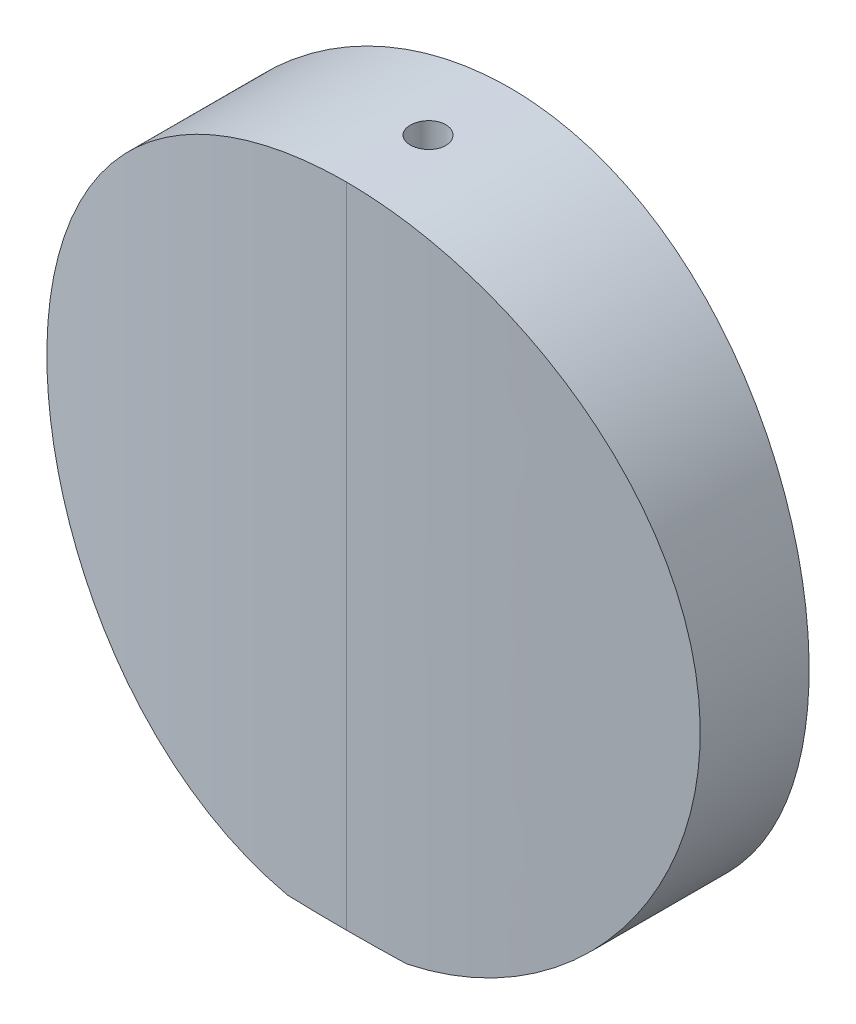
ISO-10303-21;
HEADER;
FILE_DESCRIPTION(('STEP AP214'),'2;1');
FILE_NAME('part.step','',(''),(''),'','','');
FILE_SCHEMA(('AUTOMOTIVE_DESIGN { 1 0 10303 214 1 1 1 1 }'));
ENDSEC;
DATA;
#1=APPLICATION_CONTEXT('core data for automotive mechanical design processes');
#2=APPLICATION_PROTOCOL_DEFINITION('international standard','automotive_design',2000,#1);
#3=PRODUCT_CONTEXT('',#1,'mechanical');
#4=PRODUCT('Part','Part','',(#3));
#5=PRODUCT_RELATED_PRODUCT_CATEGORY('part','',(#4));
#6=PRODUCT_DEFINITION_FORMATION('','',#4);
#7=PRODUCT_DEFINITION_CONTEXT('part definition',#1,'design');
#8=PRODUCT_DEFINITION('design','',#6,#7);
#9=PRODUCT_DEFINITION_SHAPE('','',#8);
#10=(LENGTH_UNIT() NAMED_UNIT(*) SI_UNIT(.MILLI.,.METRE.));
#11=(NAMED_UNIT(*) PLANE_ANGLE_UNIT() SI_UNIT($,.RADIAN.));
#12=(NAMED_UNIT(*) SI_UNIT($,.STERADIAN.) SOLID_ANGLE_UNIT());
#13=UNCERTAINTY_MEASURE_WITH_UNIT(LENGTH_MEASURE(1.E-05),#10,'distance_accuracy_value','');
#14=(GEOMETRIC_REPRESENTATION_CONTEXT(3) GLOBAL_UNCERTAINTY_ASSIGNED_CONTEXT((#13)) GLOBAL_UNIT_ASSIGNED_CONTEXT((#10,
#11,#12)) REPRESENTATION_CONTEXT('',''));
#15=CARTESIAN_POINT('',(0.,0.,0.));
#16=DIRECTION('',(0.,0.,1.));
#17=DIRECTION('',(1.,0.,0.));
#18=AXIS2_PLACEMENT_3D('',#15,#16,#17);
#19=CARTESIAN_POINT('',(60.,120.,-10.));
#20=CARTESIAN_POINT('',(30.8552287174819,120.,-15.));
#21=CARTESIAN_POINT('',(0.,120.,-15.));
#22=B_SPLINE_CURVE_WITH_KNOTS('',2,(#19,#20,#21),.UNSPECIFIED.,.F.,.F.,(3,3),(0.,1.),.UNSPECIFIED.);
#23=DIRECTION('',(0.,-1.,0.));
#24=VECTOR('',#23,1.);
#25=SURFACE_OF_LINEAR_EXTRUSION('',#22,#24);
#26=CARTESIAN_POINT('',(10.9087121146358,0.,-14.8422073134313));
#27=CARTESIAN_POINT('',(12.0129816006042,0.204133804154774,-14.8101245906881));
#28=CARTESIAN_POINT('',(13.1113600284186,0.439314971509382,-14.7732214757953));
#29=CARTESIAN_POINT('',(15.292749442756,0.970777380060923,-14.690266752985));
#30=CARTESIAN_POINT('',(16.3757622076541,1.26705148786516,-14.6442162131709));
#31=CARTESIAN_POINT('',(18.5230543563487,1.91974107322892,-14.5434530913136));
#32=CARTESIAN_POINT('',(19.5873344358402,2.27615431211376,-14.488740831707));
#33=CARTESIAN_POINT('',(21.6926573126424,3.04748488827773,-14.3713551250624));
#34=CARTESIAN_POINT('',(22.7337250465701,3.46233555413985,-14.3086907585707));
#35=CARTESIAN_POINT('',(24.7906212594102,4.34947765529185,-14.1760841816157));
#36=CARTESIAN_POINT('',(25.8064495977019,4.82176941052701,-14.1061419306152));
#37=CARTESIAN_POINT('',(27.8097151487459,5.82224855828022,-13.9598124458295));
#38=CARTESIAN_POINT('',(28.7971524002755,6.35043587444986,-13.8834252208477));
#39=CARTESIAN_POINT('',(30.7407485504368,7.46108899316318,-13.7251134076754));
#40=CARTESIAN_POINT('',(31.6969027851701,8.04356283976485,-13.6431879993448));
#41=CARTESIAN_POINT('',(33.5748676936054,9.26087629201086,-13.4748056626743));
#42=CARTESIAN_POINT('',(34.4966781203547,9.89571627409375,-13.3883487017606));
#43=CARTESIAN_POINT('',(36.3031495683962,11.2157684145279,-13.2119640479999));
#44=CARTESIAN_POINT('',(37.1878106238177,11.9009805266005,-13.1220363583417));
#45=CARTESIAN_POINT('',(38.9172939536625,13.3196410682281,-12.9398230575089));
#46=CARTESIAN_POINT('',(39.7621166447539,14.053088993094,-12.847537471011));
#47=CARTESIAN_POINT('',(41.4093903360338,15.5659942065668,-12.6617548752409));
#48=CARTESIAN_POINT('',(42.2118414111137,16.3454514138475,-12.5682578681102));
#49=CARTESIAN_POINT('',(43.7718940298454,17.9479345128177,-12.3812316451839));
#50=CARTESIAN_POINT('',(44.5294953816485,18.7709605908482,-12.2877024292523));
#51=CARTESIAN_POINT('',(46.3729248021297,20.8895482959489,-12.0542550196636));
#52=CARTESIAN_POINT('',(47.4286134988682,22.2116351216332,-11.9150586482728));
#53=CARTESIAN_POINT('',(49.4248192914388,24.9405522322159,-11.6433491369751));
#54=CARTESIAN_POINT('',(50.3653356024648,26.3473830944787,-11.5108360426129));
#55=CARTESIAN_POINT('',(52.124695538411,29.2363248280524,-11.2563755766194));
#56=CARTESIAN_POINT('',(52.9435276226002,30.7184428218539,-11.1344292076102));
#57=CARTESIAN_POINT('',(54.4533985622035,33.7474535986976,-10.9047683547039));
#58=CARTESIAN_POINT('',(55.1444381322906,35.2943460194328,-10.797053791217));
#59=CARTESIAN_POINT('',(56.3921150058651,38.4383146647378,-10.5993509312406));
#60=CARTESIAN_POINT('',(56.949063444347,40.0352648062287,-10.5093216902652));
#61=CARTESIAN_POINT('',(57.9264067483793,43.2714167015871,-10.3494250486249));
#62=CARTESIAN_POINT('',(58.3468016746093,44.910618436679,-10.2795576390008));
#63=CARTESIAN_POINT('',(59.0477294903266,48.2192377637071,-10.1621485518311));
#64=CARTESIAN_POINT('',(59.328279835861,49.8886515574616,-10.1146040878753));
#65=CARTESIAN_POINT('',(59.7473798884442,53.2457081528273,-10.0433080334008));
#66=CARTESIAN_POINT('',(59.8859310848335,54.93335076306,-10.0195561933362));
#67=CARTESIAN_POINT('',(60.0190686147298,58.2926023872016,-9.99673477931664));
#68=CARTESIAN_POINT('',(60.0154925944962,59.9641366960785,-9.99735014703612));
#69=CARTESIAN_POINT('',(59.8689495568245,63.3008922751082,-10.0224642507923));
#70=CARTESIAN_POINT('',(59.7259837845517,64.9661136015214,-10.0469627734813));
#71=CARTESIAN_POINT('',(59.3017755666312,68.2783117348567,-10.1190962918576));
#72=CARTESIAN_POINT('',(59.0205348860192,69.925288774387,-10.1667309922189));
#73=CARTESIAN_POINT('',(58.3219385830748,73.1893268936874,-10.2836930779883));
#74=CARTESIAN_POINT('',(57.9045826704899,74.8063879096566,-10.3530205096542));
#75=CARTESIAN_POINT('',(56.9382584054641,77.9947884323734,-10.5110636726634));
#76=CARTESIAN_POINT('',(56.3896588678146,79.5662424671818,-10.5997250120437));
#77=CARTESIAN_POINT('',(55.1642836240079,82.6572571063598,-10.7939240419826));
#78=CARTESIAN_POINT('',(54.4875083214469,84.1768178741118,-10.8994616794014));
#79=CARTESIAN_POINT('',(53.0105831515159,87.1538518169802,-11.1243400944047));
#80=CARTESIAN_POINT('',(52.2104216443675,88.6113191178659,-11.2436821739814));
#81=CARTESIAN_POINT('',(50.4923973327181,91.4542186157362,-11.4927189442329));
#82=CARTESIAN_POINT('',(49.5745333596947,92.8396500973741,-11.6224137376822));
#83=CARTESIAN_POINT('',(47.6158345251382,95.5452401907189,-11.890047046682));
#84=CARTESIAN_POINT('',(46.5736658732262,96.8644254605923,-12.0280653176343));
#85=CARTESIAN_POINT('',(44.3825013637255,99.4105746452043,-12.3069486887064));
#86=CARTESIAN_POINT('',(43.2335044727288,100.637537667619,-12.447813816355));
#87=CARTESIAN_POINT('',(40.8366000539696,102.990831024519,-12.7283815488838));
#88=CARTESIAN_POINT('',(39.5886914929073,104.117160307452,-12.8680841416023));
#89=CARTESIAN_POINT('',(37.0023327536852,106.261489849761,-13.1424077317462));
#90=CARTESIAN_POINT('',(35.6638832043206,107.279490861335,-13.2770287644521));
#91=CARTESIAN_POINT('',(33.3586260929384,108.884638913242,-13.4946827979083));
#92=CARTESIAN_POINT('',(32.4139823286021,109.503554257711,-13.5801487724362));
#93=CARTESIAN_POINT('',(30.4908821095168,110.687335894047,-13.7460447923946));
#94=CARTESIAN_POINT('',(29.5124250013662,111.252201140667,-13.8264747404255));
#95=CARTESIAN_POINT('',(27.5247883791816,112.325998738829,-13.981300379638));
#96=CARTESIAN_POINT('',(26.5156075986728,112.834928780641,-14.0556958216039));
#97=CARTESIAN_POINT('',(24.4699751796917,113.795041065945,-14.197524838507));
#98=CARTESIAN_POINT('',(23.4335307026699,114.246238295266,-14.2649602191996));
#99=CARTESIAN_POINT('',(21.3364538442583,115.089508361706,-14.3920764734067));
#100=CARTESIAN_POINT('',(20.2758224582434,115.481583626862,-14.4517576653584));
#101=CARTESIAN_POINT('',(18.1338492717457,116.205254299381,-14.5626555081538));
#102=CARTESIAN_POINT('',(17.0525108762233,116.53685955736,-14.6138735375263));
#103=CARTESIAN_POINT('',(15.097420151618,117.0764453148,-14.697630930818));
#104=CARTESIAN_POINT('',(14.2268625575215,117.295816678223,-14.7318438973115));
#105=CARTESIAN_POINT('',(12.4766793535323,117.695297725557,-14.7943325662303));
#106=CARTESIAN_POINT('',(11.5970549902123,117.875412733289,-14.8226090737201));
#107=CARTESIAN_POINT('',(9.83050475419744,118.196004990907,-14.873037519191));
#108=CARTESIAN_POINT('',(8.94357938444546,118.336484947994,-14.895189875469));
#109=CARTESIAN_POINT('',(7.16464899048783,118.577454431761,-14.9332258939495));
#110=CARTESIAN_POINT('',(6.27264685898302,118.677964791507,-14.9491128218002));
#111=CARTESIAN_POINT('',(4.48487250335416,118.83887827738,-14.9745470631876));
#112=CARTESIAN_POINT('',(3.58909999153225,118.899278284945,-14.9840938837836));
#113=CARTESIAN_POINT('',(1.79555241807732,118.979850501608,-14.9968256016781));
#114=CARTESIAN_POINT('',(0.897777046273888,119.000015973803,-15.0000094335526));
#115=CARTESIAN_POINT('',(0.,119.,-15.));
#116=B_SPLINE_CURVE_WITH_KNOTS('',3,(#26,#27,#28,#29,#30,#31,#32,#33,#34,#35,#36,#37,#38,#39,
#40,#41,#42,#43,#44,#45,#46,#47,#48,#49,#50,#51,#52,#53,#54,#55,#56,#57,#58,#59,#60,#61,#62,#63,
#64,#65,#66,#67,#68,#69,#70,#71,#72,#73,#74,#75,#76,#77,#78,#79,#80,#81,#82,#83,#84,#85,#86,#87,
#88,#89,#90,#91,#92,#93,#94,#95,#96,#97,#98,#99,#100,#101,#102,#103,#104,#105,#106,#107,#108,
#109,#110,#111,#112,#113,#114,#115),.UNSPECIFIED.,.F.,.F.,(4,2,2,2,2,2,2,2,2,2,2,2,2,2,2,2,2,2,
2,2,2,2,2,2,2,2,2,2,2,2,2,2,2,2,2,2,2,2,2,2,2,2,2,2,4),(0.,3.36984264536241,6.73929204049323,
10.1086160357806,13.4741266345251,16.8396559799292,20.2051807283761,23.5712049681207,
26.9372534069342,30.3032987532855,33.6693088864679,37.035313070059,40.4013316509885,
45.4876694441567,50.5740418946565,55.6608964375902,60.7477225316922,65.8226292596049,
70.8975337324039,75.971804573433,81.0460221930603,86.0546538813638,91.063240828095,
96.0717638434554,101.080297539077,106.074918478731,111.069523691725,116.064600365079,
121.05972663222,126.114315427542,131.168953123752,136.223643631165,141.27829903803,
144.674362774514,148.070492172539,151.466761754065,154.862147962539,158.257394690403,
161.652087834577,164.346479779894,167.040506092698,169.734348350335,172.426784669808,
175.11943030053,177.81252675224),.UNSPECIFIED.);
#117=CARTESIAN_POINT('',(10.9087121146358,0.,-14.8422073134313));
#118=VERTEX_POINT('',#117);
#119=CARTESIAN_POINT('',(0.,119.,-15.));
#120=VERTEX_POINT('',#119);
#121=EDGE_CURVE('E89',#118,#120,#116,.T.);
#122=ORIENTED_EDGE('',*,*,#121,.F.);
#123=CARTESIAN_POINT('',(60.,0.,-10.));
#124=CARTESIAN_POINT('',(30.8552287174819,0.,-15.));
#125=CARTESIAN_POINT('',(0.,0.,-15.));
#126=B_SPLINE_CURVE_WITH_KNOTS('',2,(#123,#124,#125),.UNSPECIFIED.,.F.,.F.,(3,3),(0.,1.),.UNSPECIFIED.);
#127=CARTESIAN_POINT('',(0.,0.,-15.));
#128=VERTEX_POINT('',#127);
#129=EDGE_CURVE('E98',#118,#128,#126,.T.);
#130=ORIENTED_EDGE('',*,*,#129,.T.);
#131=DIRECTION('',(0.,-1.,0.));
#132=VECTOR('',#131,1.);
#133=CARTESIAN_POINT('',(0.,120.,-15.));
#134=LINE('',#133,#132);
#135=EDGE_CURVE('E94',#120,#128,#134,.T.);
#136=ORIENTED_EDGE('',*,*,#135,.F.);
#137=EDGE_LOOP('',(#122,#130,#136));
#138=FACE_BOUND('',#137,.T.);
#139=ADVANCED_FACE('F48',(#138),#25,.F.);
#140=CARTESIAN_POINT('',(-60.,120.,-10.));
#141=CARTESIAN_POINT('',(-30.8552287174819,120.,-15.));
#142=CARTESIAN_POINT('',(0.,120.,-15.));
#143=B_SPLINE_CURVE_WITH_KNOTS('',2,(#140,#141,#142),.UNSPECIFIED.,.F.,.F.,(3,3),(0.,1.),.UNSPECIFIED.);
#144=DIRECTION('',(0.,-1.,0.));
#145=VECTOR('',#144,1.);
#146=SURFACE_OF_LINEAR_EXTRUSION('',#143,#145);
#147=CARTESIAN_POINT('',(-60.,0.,-10.));
#148=CARTESIAN_POINT('',(-30.8552287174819,0.,-15.));
#149=CARTESIAN_POINT('',(0.,0.,-15.));
#150=B_SPLINE_CURVE_WITH_KNOTS('',2,(#147,#148,#149),.UNSPECIFIED.,.F.,.F.,(3,3),(0.,1.),.UNSPECIFIED.);
#151=CARTESIAN_POINT('',(-10.9087121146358,0.,-14.8422073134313));
#152=VERTEX_POINT('',#151);
#153=EDGE_CURVE('E104',#152,#128,#150,.T.);
#154=ORIENTED_EDGE('',*,*,#153,.F.);
#155=CARTESIAN_POINT('',(-10.9087121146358,0.,-14.8422073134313));
#156=CARTESIAN_POINT('',(-12.0129816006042,0.204133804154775,-14.8101245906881));
#157=CARTESIAN_POINT('',(-13.1113600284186,0.439314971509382,-14.7732214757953));
#158=CARTESIAN_POINT('',(-15.292749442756,0.970777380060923,-14.690266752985));
#159=CARTESIAN_POINT('',(-16.3757622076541,1.26705148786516,-14.6442162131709));
#160=CARTESIAN_POINT('',(-18.5230543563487,1.91974107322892,-14.5434530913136));
#161=CARTESIAN_POINT('',(-19.5873344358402,2.27615431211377,-14.488740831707));
#162=CARTESIAN_POINT('',(-21.6926573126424,3.04748488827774,-14.3713551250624));
#163=CARTESIAN_POINT('',(-22.7337250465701,3.46233555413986,-14.3086907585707));
#164=CARTESIAN_POINT('',(-24.7906212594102,4.34947765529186,-14.1760841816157));
#165=CARTESIAN_POINT('',(-25.806449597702,4.82176941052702,-14.1061419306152));
#166=CARTESIAN_POINT('',(-27.8097151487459,5.82224855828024,-13.9598124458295));
#167=CARTESIAN_POINT('',(-28.7971524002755,6.35043587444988,-13.8834252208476));
#168=CARTESIAN_POINT('',(-30.7407485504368,7.4610889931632,-13.7251134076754));
#169=CARTESIAN_POINT('',(-31.6969027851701,8.04356283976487,-13.6431879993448));
#170=CARTESIAN_POINT('',(-33.5748676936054,9.26087629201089,-13.4748056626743));
#171=CARTESIAN_POINT('',(-34.4966781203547,9.89571627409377,-13.3883487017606));
#172=CARTESIAN_POINT('',(-36.3031495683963,11.2157684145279,-13.2119640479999));
#173=CARTESIAN_POINT('',(-37.1878106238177,11.9009805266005,-13.1220363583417));
#174=CARTESIAN_POINT('',(-38.9172939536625,13.3196410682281,-12.9398230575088));
#175=CARTESIAN_POINT('',(-39.7621166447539,14.053088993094,-12.847537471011));
#176=CARTESIAN_POINT('',(-41.4093903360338,15.5659942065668,-12.6617548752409));
#177=CARTESIAN_POINT('',(-42.2118414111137,16.3454514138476,-12.5682578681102));
#178=CARTESIAN_POINT('',(-43.7718940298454,17.9479345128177,-12.3812316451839));
#179=CARTESIAN_POINT('',(-44.5294953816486,18.7709605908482,-12.2877024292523));
#180=CARTESIAN_POINT('',(-46.3729248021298,20.889548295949,-12.0542550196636));
#181=CARTESIAN_POINT('',(-47.4286134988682,22.2116351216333,-11.9150586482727));
#182=CARTESIAN_POINT('',(-49.4248192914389,24.940552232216,-11.6433491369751));
#183=CARTESIAN_POINT('',(-50.3653356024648,26.3473830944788,-11.5108360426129));
#184=CARTESIAN_POINT('',(-52.124695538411,29.2363248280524,-11.2563755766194));
#185=CARTESIAN_POINT('',(-52.9435276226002,30.718442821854,-11.1344292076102));
#186=CARTESIAN_POINT('',(-54.4533985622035,33.7474535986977,-10.9047683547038));
#187=CARTESIAN_POINT('',(-55.1444381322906,35.2943460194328,-10.797053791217));
#188=CARTESIAN_POINT('',(-56.3921150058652,38.4383146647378,-10.5993509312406));
#189=CARTESIAN_POINT('',(-56.949063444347,40.0352648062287,-10.5093216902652));
#190=CARTESIAN_POINT('',(-57.9264067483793,43.2714167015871,-10.3494250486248));
#191=CARTESIAN_POINT('',(-58.3468016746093,44.910618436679,-10.2795576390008));
#192=CARTESIAN_POINT('',(-59.0477294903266,48.2192377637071,-10.1621485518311));
#193=CARTESIAN_POINT('',(-59.328279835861,49.8886515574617,-10.1146040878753));
#194=CARTESIAN_POINT('',(-59.7473798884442,53.2457081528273,-10.0433080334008));
#195=CARTESIAN_POINT('',(-59.8859310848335,54.9333507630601,-10.0195561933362));
#196=CARTESIAN_POINT('',(-60.0190686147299,58.2926023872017,-9.99673477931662));
#197=CARTESIAN_POINT('',(-60.0154925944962,59.9641366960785,-9.9973501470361));
#198=CARTESIAN_POINT('',(-59.8689495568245,63.3008922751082,-10.0224642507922));
#199=CARTESIAN_POINT('',(-59.7259837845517,64.9661136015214,-10.0469627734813));
#200=CARTESIAN_POINT('',(-59.3017755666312,68.2783117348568,-10.1190962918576));
#201=CARTESIAN_POINT('',(-59.0205348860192,69.9252887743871,-10.1667309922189));
#202=CARTESIAN_POINT('',(-58.3219385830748,73.1893268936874,-10.2836930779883));
#203=CARTESIAN_POINT('',(-57.9045826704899,74.8063879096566,-10.3530205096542));
#204=CARTESIAN_POINT('',(-56.938258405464,77.9947884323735,-10.5110636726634));
#205=CARTESIAN_POINT('',(-56.3896588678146,79.5662424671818,-10.5997250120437));
#206=CARTESIAN_POINT('',(-55.1642836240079,82.6572571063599,-10.7939240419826));
#207=CARTESIAN_POINT('',(-54.4875083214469,84.1768178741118,-10.8994616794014));
#208=CARTESIAN_POINT('',(-53.0105831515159,87.1538518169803,-11.1243400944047));
#209=CARTESIAN_POINT('',(-52.2104216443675,88.611319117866,-11.2436821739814));
#210=CARTESIAN_POINT('',(-50.4923973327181,91.4542186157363,-11.4927189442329));
#211=CARTESIAN_POINT('',(-49.5745333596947,92.8396500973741,-11.6224137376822));
#212=CARTESIAN_POINT('',(-47.6158345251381,95.5452401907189,-11.890047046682));
#213=CARTESIAN_POINT('',(-46.5736658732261,96.8644254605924,-12.0280653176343));
#214=CARTESIAN_POINT('',(-44.3825013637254,99.4105746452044,-12.3069486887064));
#215=CARTESIAN_POINT('',(-43.2335044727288,100.637537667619,-12.447813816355));
#216=CARTESIAN_POINT('',(-40.8366000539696,102.990831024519,-12.7283815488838));
#217=CARTESIAN_POINT('',(-39.5886914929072,104.117160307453,-12.8680841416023));
#218=CARTESIAN_POINT('',(-37.0023327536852,106.261489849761,-13.1424077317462));
#219=CARTESIAN_POINT('',(-35.6638832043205,107.279490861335,-13.277028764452));
#220=CARTESIAN_POINT('',(-33.3586260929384,108.884638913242,-13.4946827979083));
#221=CARTESIAN_POINT('',(-32.413982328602,109.503554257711,-13.5801487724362));
#222=CARTESIAN_POINT('',(-30.4908821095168,110.687335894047,-13.7460447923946));
#223=CARTESIAN_POINT('',(-29.5124250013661,111.252201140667,-13.8264747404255));
#224=CARTESIAN_POINT('',(-27.5247883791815,112.325998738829,-13.981300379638));
#225=CARTESIAN_POINT('',(-26.5156075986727,112.834928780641,-14.0556958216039));
#226=CARTESIAN_POINT('',(-24.4699751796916,113.795041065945,-14.197524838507));
#227=CARTESIAN_POINT('',(-23.4335307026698,114.246238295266,-14.2649602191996));
#228=CARTESIAN_POINT('',(-21.3364538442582,115.089508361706,-14.3920764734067));
#229=CARTESIAN_POINT('',(-20.2758224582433,115.481583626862,-14.4517576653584));
#230=CARTESIAN_POINT('',(-18.1338492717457,116.205254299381,-14.5626555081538));
#231=CARTESIAN_POINT('',(-17.0525108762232,116.53685955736,-14.6138735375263));
#232=CARTESIAN_POINT('',(-15.0974201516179,117.0764453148,-14.697630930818));
#233=CARTESIAN_POINT('',(-14.2268625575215,117.295816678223,-14.7318438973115));
#234=CARTESIAN_POINT('',(-12.4766793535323,117.695297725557,-14.7943325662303));
#235=CARTESIAN_POINT('',(-11.5970549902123,117.875412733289,-14.8226090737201));
#236=CARTESIAN_POINT('',(-9.8305047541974,118.196004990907,-14.873037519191));
#237=CARTESIAN_POINT('',(-8.94357938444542,118.336484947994,-14.895189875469));
#238=CARTESIAN_POINT('',(-7.1646489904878,118.577454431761,-14.9332258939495));
#239=CARTESIAN_POINT('',(-6.27264685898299,118.677964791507,-14.9491128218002));
#240=CARTESIAN_POINT('',(-4.48487250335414,118.83887827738,-14.9745470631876));
#241=CARTESIAN_POINT('',(-3.58909999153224,118.899278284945,-14.9840938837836));
#242=CARTESIAN_POINT('',(-1.79555241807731,118.979850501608,-14.9968256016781));
#243=CARTESIAN_POINT('',(-0.89777704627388,119.000015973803,-15.0000094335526));
#244=CARTESIAN_POINT('',(0.,119.,-15.));
#245=B_SPLINE_CURVE_WITH_KNOTS('',3,(#155,#156,#157,#158,#159,#160,#161,#162,#163,#164,#165,
#166,#167,#168,#169,#170,#171,#172,#173,#174,#175,#176,#177,#178,#179,#180,#181,#182,#183,#184,
#185,#186,#187,#188,#189,#190,#191,#192,#193,#194,#195,#196,#197,#198,#199,#200,#201,#202,#203,
#204,#205,#206,#207,#208,#209,#210,#211,#212,#213,#214,#215,#216,#217,#218,#219,#220,#221,#222,
#223,#224,#225,#226,#227,#228,#229,#230,#231,#232,#233,#234,#235,#236,#237,#238,#239,#240,#241,
#242,#243,#244),.UNSPECIFIED.,.F.,.F.,(4,2,2,2,2,2,2,2,2,2,2,2,2,2,2,2,2,2,2,2,2,2,2,2,2,2,2,2,
2,2,2,2,2,2,2,2,2,2,2,2,2,2,2,2,4),(0.,3.36984264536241,6.73929204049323,10.1086160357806,
13.4741266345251,16.8396559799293,20.2051807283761,23.5712049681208,26.9372534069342,
30.3032987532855,33.6693088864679,37.035313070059,40.4013316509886,45.4876694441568,
50.5740418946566,55.6608964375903,60.7477225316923,65.8226292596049,70.8975337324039,
75.9718045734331,81.0460221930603,86.0546538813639,91.063240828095,96.0717638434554,
101.080297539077,106.074918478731,111.069523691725,116.064600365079,121.05972663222,
126.114315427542,131.168953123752,136.223643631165,141.27829903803,144.674362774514,
148.070492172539,151.466761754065,154.86214796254,158.257394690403,161.652087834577,
164.346479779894,167.040506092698,169.734348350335,172.426784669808,175.11943030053,
177.81252675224),.UNSPECIFIED.);
#246=EDGE_CURVE('E140',#152,#120,#245,.T.);
#247=ORIENTED_EDGE('',*,*,#246,.T.);
#248=ORIENTED_EDGE('',*,*,#135,.T.);
#249=EDGE_LOOP('',(#154,#247,#248));
#250=FACE_BOUND('',#249,.T.);
#251=ADVANCED_FACE('F139',(#250),#146,.T.);
#252=CARTESIAN_POINT('',(-60.,120.,10.));
#253=CARTESIAN_POINT('',(-30.8552287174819,120.,15.));
#254=CARTESIAN_POINT('',(0.,120.,15.));
#255=B_SPLINE_CURVE_WITH_KNOTS('',2,(#252,#253,#254),.UNSPECIFIED.,.F.,.F.,(3,3),(0.,1.),.UNSPECIFIED.);
#256=DIRECTION('',(0.,-1.,0.));
#257=VECTOR('',#256,1.);
#258=SURFACE_OF_LINEAR_EXTRUSION('',#255,#257);
#259=CARTESIAN_POINT('',(-10.9087121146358,0.,14.8422073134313));
#260=CARTESIAN_POINT('',(-12.0129816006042,0.204133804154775,14.8101245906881));
#261=CARTESIAN_POINT('',(-13.1113600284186,0.439314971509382,14.7732214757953));
#262=CARTESIAN_POINT('',(-15.292749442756,0.970777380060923,14.690266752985));
#263=CARTESIAN_POINT('',(-16.3757622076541,1.26705148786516,14.6442162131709));
#264=CARTESIAN_POINT('',(-18.5230543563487,1.91974107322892,14.5434530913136));
#265=CARTESIAN_POINT('',(-19.5873344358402,2.27615431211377,14.488740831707));
#266=CARTESIAN_POINT('',(-21.6926573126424,3.04748488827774,14.3713551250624));
#267=CARTESIAN_POINT('',(-22.7337250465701,3.46233555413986,14.3086907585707));
#268=CARTESIAN_POINT('',(-24.7906212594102,4.34947765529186,14.1760841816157));
#269=CARTESIAN_POINT('',(-25.806449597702,4.82176941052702,14.1061419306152));
#270=CARTESIAN_POINT('',(-27.8097151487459,5.82224855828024,13.9598124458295));
#271=CARTESIAN_POINT('',(-28.7971524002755,6.35043587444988,13.8834252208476));
#272=CARTESIAN_POINT('',(-30.7407485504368,7.4610889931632,13.7251134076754));
#273=CARTESIAN_POINT('',(-31.6969027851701,8.04356283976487,13.6431879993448));
#274=CARTESIAN_POINT('',(-33.5748676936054,9.26087629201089,13.4748056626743));
#275=CARTESIAN_POINT('',(-34.4966781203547,9.89571627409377,13.3883487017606));
#276=CARTESIAN_POINT('',(-36.3031495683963,11.2157684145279,13.2119640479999));
#277=CARTESIAN_POINT('',(-37.1878106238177,11.9009805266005,13.1220363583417));
#278=CARTESIAN_POINT('',(-38.9172939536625,13.3196410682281,12.9398230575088));
#279=CARTESIAN_POINT('',(-39.7621166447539,14.053088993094,12.847537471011));
#280=CARTESIAN_POINT('',(-41.4093903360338,15.5659942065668,12.6617548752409));
#281=CARTESIAN_POINT('',(-42.2118414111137,16.3454514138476,12.5682578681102));
#282=CARTESIAN_POINT('',(-43.7718940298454,17.9479345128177,12.3812316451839));
#283=CARTESIAN_POINT('',(-44.5294953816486,18.7709605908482,12.2877024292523));
#284=CARTESIAN_POINT('',(-46.3729248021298,20.889548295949,12.0542550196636));
#285=CARTESIAN_POINT('',(-47.4286134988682,22.2116351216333,11.9150586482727));
#286=CARTESIAN_POINT('',(-49.4248192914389,24.940552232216,11.6433491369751));
#287=CARTESIAN_POINT('',(-50.3653356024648,26.3473830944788,11.5108360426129));
#288=CARTESIAN_POINT('',(-52.124695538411,29.2363248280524,11.2563755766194));
#289=CARTESIAN_POINT('',(-52.9435276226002,30.718442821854,11.1344292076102));
#290=CARTESIAN_POINT('',(-54.4533985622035,33.7474535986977,10.9047683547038));
#291=CARTESIAN_POINT('',(-55.1444381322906,35.2943460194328,10.797053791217));
#292=CARTESIAN_POINT('',(-56.3921150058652,38.4383146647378,10.5993509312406));
#293=CARTESIAN_POINT('',(-56.949063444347,40.0352648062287,10.5093216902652));
#294=CARTESIAN_POINT('',(-57.9264067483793,43.2714167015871,10.3494250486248));
#295=CARTESIAN_POINT('',(-58.3468016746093,44.910618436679,10.2795576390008));
#296=CARTESIAN_POINT('',(-59.0477294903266,48.2192377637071,10.1621485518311));
#297=CARTESIAN_POINT('',(-59.328279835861,49.8886515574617,10.1146040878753));
#298=CARTESIAN_POINT('',(-59.7473798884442,53.2457081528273,10.0433080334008));
#299=CARTESIAN_POINT('',(-59.8859310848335,54.9333507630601,10.0195561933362));
#300=CARTESIAN_POINT('',(-60.0190686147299,58.2926023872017,9.99673477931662));
#301=CARTESIAN_POINT('',(-60.0154925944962,59.9641366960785,9.9973501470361));
#302=CARTESIAN_POINT('',(-59.8689495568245,63.3008922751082,10.0224642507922));
#303=CARTESIAN_POINT('',(-59.7259837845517,64.9661136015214,10.0469627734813));
#304=CARTESIAN_POINT('',(-59.3017755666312,68.2783117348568,10.1190962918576));
#305=CARTESIAN_POINT('',(-59.0205348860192,69.9252887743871,10.1667309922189));
#306=CARTESIAN_POINT('',(-58.3219385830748,73.1893268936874,10.2836930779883));
#307=CARTESIAN_POINT('',(-57.9045826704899,74.8063879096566,10.3530205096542));
#308=CARTESIAN_POINT('',(-56.938258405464,77.9947884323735,10.5110636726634));
#309=CARTESIAN_POINT('',(-56.3896588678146,79.5662424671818,10.5997250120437));
#310=CARTESIAN_POINT('',(-55.1642836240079,82.6572571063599,10.7939240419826));
#311=CARTESIAN_POINT('',(-54.4875083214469,84.1768178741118,10.8994616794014));
#312=CARTESIAN_POINT('',(-53.0105831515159,87.1538518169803,11.1243400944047));
#313=CARTESIAN_POINT('',(-52.2104216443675,88.611319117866,11.2436821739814));
#314=CARTESIAN_POINT('',(-50.4923973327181,91.4542186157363,11.4927189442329));
#315=CARTESIAN_POINT('',(-49.5745333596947,92.8396500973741,11.6224137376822));
#316=CARTESIAN_POINT('',(-47.6158345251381,95.5452401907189,11.890047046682));
#317=CARTESIAN_POINT('',(-46.5736658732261,96.8644254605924,12.0280653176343));
#318=CARTESIAN_POINT('',(-44.3825013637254,99.4105746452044,12.3069486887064));
#319=CARTESIAN_POINT('',(-43.2335044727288,100.637537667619,12.447813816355));
#320=CARTESIAN_POINT('',(-40.8366000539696,102.990831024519,12.7283815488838));
#321=CARTESIAN_POINT('',(-39.5886914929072,104.117160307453,12.8680841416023));
#322=CARTESIAN_POINT('',(-37.0023327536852,106.261489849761,13.1424077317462));
#323=CARTESIAN_POINT('',(-35.6638832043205,107.279490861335,13.277028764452));
#324=CARTESIAN_POINT('',(-33.3586260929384,108.884638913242,13.4946827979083));
#325=CARTESIAN_POINT('',(-32.413982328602,109.503554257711,13.5801487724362));
#326=CARTESIAN_POINT('',(-30.4908821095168,110.687335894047,13.7460447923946));
#327=CARTESIAN_POINT('',(-29.5124250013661,111.252201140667,13.8264747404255));
#328=CARTESIAN_POINT('',(-27.5247883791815,112.325998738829,13.981300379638));
#329=CARTESIAN_POINT('',(-26.5156075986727,112.834928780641,14.0556958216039));
#330=CARTESIAN_POINT('',(-24.4699751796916,113.795041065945,14.197524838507));
#331=CARTESIAN_POINT('',(-23.4335307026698,114.246238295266,14.2649602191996));
#332=CARTESIAN_POINT('',(-21.3364538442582,115.089508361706,14.3920764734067));
#333=CARTESIAN_POINT('',(-20.2758224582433,115.481583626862,14.4517576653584));
#334=CARTESIAN_POINT('',(-18.1338492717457,116.205254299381,14.5626555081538));
#335=CARTESIAN_POINT('',(-17.0525108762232,116.53685955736,14.6138735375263));
#336=CARTESIAN_POINT('',(-15.0974201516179,117.0764453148,14.697630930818));
#337=CARTESIAN_POINT('',(-14.2268625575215,117.295816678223,14.7318438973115));
#338=CARTESIAN_POINT('',(-12.4766793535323,117.695297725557,14.7943325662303));
#339=CARTESIAN_POINT('',(-11.5970549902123,117.875412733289,14.8226090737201));
#340=CARTESIAN_POINT('',(-9.8305047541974,118.196004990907,14.873037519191));
#341=CARTESIAN_POINT('',(-8.94357938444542,118.336484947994,14.895189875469));
#342=CARTESIAN_POINT('',(-7.1646489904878,118.577454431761,14.9332258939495));
#343=CARTESIAN_POINT('',(-6.27264685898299,118.677964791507,14.9491128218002));
#344=CARTESIAN_POINT('',(-4.48487250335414,118.83887827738,14.9745470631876));
#345=CARTESIAN_POINT('',(-3.58909999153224,118.899278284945,14.9840938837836));
#346=CARTESIAN_POINT('',(-1.79555241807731,118.979850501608,14.9968256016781));
#347=CARTESIAN_POINT('',(-0.89777704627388,119.000015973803,15.0000094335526));
#348=CARTESIAN_POINT('',(0.,119.,15.));
#349=B_SPLINE_CURVE_WITH_KNOTS('',3,(#259,#260,#261,#262,#263,#264,#265,#266,#267,#268,#269,
#270,#271,#272,#273,#274,#275,#276,#277,#278,#279,#280,#281,#282,#283,#284,#285,#286,#287,#288,
#289,#290,#291,#292,#293,#294,#295,#296,#297,#298,#299,#300,#301,#302,#303,#304,#305,#306,#307,
#308,#309,#310,#311,#312,#313,#314,#315,#316,#317,#318,#319,#320,#321,#322,#323,#324,#325,#326,
#327,#328,#329,#330,#331,#332,#333,#334,#335,#336,#337,#338,#339,#340,#341,#342,#343,#344,#345,
#346,#347,#348),.UNSPECIFIED.,.F.,.F.,(4,2,2,2,2,2,2,2,2,2,2,2,2,2,2,2,2,2,2,2,2,2,2,2,2,2,2,2,
2,2,2,2,2,2,2,2,2,2,2,2,2,2,2,2,4),(0.,3.36984264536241,6.73929204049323,10.1086160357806,
13.4741266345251,16.8396559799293,20.2051807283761,23.5712049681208,26.9372534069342,
30.3032987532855,33.6693088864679,37.035313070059,40.4013316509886,45.4876694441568,
50.5740418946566,55.6608964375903,60.7477225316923,65.8226292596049,70.8975337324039,
75.9718045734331,81.0460221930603,86.0546538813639,91.063240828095,96.0717638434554,
101.080297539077,106.074918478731,111.069523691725,116.064600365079,121.05972663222,
126.114315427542,131.168953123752,136.223643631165,141.27829903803,144.674362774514,
148.070492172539,151.466761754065,154.86214796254,158.257394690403,161.652087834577,
164.346479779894,167.040506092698,169.734348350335,172.426784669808,175.11943030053,
177.81252675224),.UNSPECIFIED.);
#350=CARTESIAN_POINT('',(-10.9087121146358,0.,14.8422073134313));
#351=VERTEX_POINT('',#350);
#352=CARTESIAN_POINT('',(0.,119.,15.));
#353=VERTEX_POINT('',#352);
#354=EDGE_CURVE('E141',#351,#353,#349,.T.);
#355=ORIENTED_EDGE('',*,*,#354,.F.);
#356=CARTESIAN_POINT('',(-60.,0.,10.));
#357=CARTESIAN_POINT('',(-30.8552287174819,0.,15.));
#358=CARTESIAN_POINT('',(0.,0.,15.));
#359=B_SPLINE_CURVE_WITH_KNOTS('',2,(#356,#357,#358),.UNSPECIFIED.,.F.,.F.,(3,3),(0.,1.),.UNSPECIFIED.);
#360=CARTESIAN_POINT('',(0.,0.,15.));
#361=VERTEX_POINT('',#360);
#362=EDGE_CURVE('E107',#351,#361,#359,.T.);
#363=ORIENTED_EDGE('',*,*,#362,.T.);
#364=DIRECTION('',(0.,-1.,0.));
#365=VECTOR('',#364,1.);
#366=CARTESIAN_POINT('',(0.,120.,15.));
#367=LINE('',#366,#365);
#368=EDGE_CURVE('E71',#353,#361,#367,.T.);
#369=ORIENTED_EDGE('',*,*,#368,.F.);
#370=EDGE_LOOP('',(#355,#363,#369));
#371=FACE_BOUND('',#370,.T.);
#372=ADVANCED_FACE('F200',(#371),#258,.F.);
#373=CARTESIAN_POINT('',(0.,120.,0.));
#374=DIRECTION('',(0.,-1.,0.));
#375=DIRECTION('',(0.,0.,-1.));
#376=AXIS2_PLACEMENT_3D('',#373,#374,#375);
#377=CYLINDRICAL_SURFACE('',#376,3.25);
#378=CARTESIAN_POINT('',(0.,0.,0.));
#379=DIRECTION('',(0.,1.,0.));
#380=DIRECTION('',(0.,0.,1.));
#381=AXIS2_PLACEMENT_3D('',#378,#379,#380);
#382=CIRCLE('',#381,3.25);
#383=CARTESIAN_POINT('',(0.,0.,3.25));
#384=VERTEX_POINT('',#383);
#385=EDGE_CURVE('E105',#384,#384,#382,.T.);
#386=ORIENTED_EDGE('',*,*,#385,.F.);
#387=EDGE_LOOP('',(#386));
#388=FACE_BOUND('',#387,.T.);
#389=CARTESIAN_POINT('',(0.,119.,-3.25));
#390=CARTESIAN_POINT('',(-0.182410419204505,118.999998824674,-3.24999195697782));
#391=CARTESIAN_POINT('',(-0.364949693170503,118.999159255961,-3.2345913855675));
#392=CARTESIAN_POINT('',(-0.724991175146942,118.99589076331,-3.17337467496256));
#393=CARTESIAN_POINT('',(-0.902487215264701,118.993459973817,-3.12752283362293));
#394=CARTESIAN_POINT('',(-1.24717467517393,118.987284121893,-3.00672151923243));
#395=CARTESIAN_POINT('',(-1.41437135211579,118.983539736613,-2.9317870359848));
#396=CARTESIAN_POINT('',(-1.73376829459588,118.975158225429,-2.7549709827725));
#397=CARTESIAN_POINT('',(-1.88597205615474,118.970521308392,-2.65309571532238));
#398=CARTESIAN_POINT('',(-2.17128414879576,118.960870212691,-2.42515911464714));
#399=CARTESIAN_POINT('',(-2.3043728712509,118.955855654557,-2.29907325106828));
#400=CARTESIAN_POINT('',(-2.54750966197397,118.946017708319,-2.02634417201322));
#401=CARTESIAN_POINT('',(-2.65755678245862,118.941194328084,-1.87970011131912));
#402=CARTESIAN_POINT('',(-2.85154308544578,118.932279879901,-1.56991126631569));
#403=CARTESIAN_POINT('',(-2.93546657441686,118.928189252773,-1.40675664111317));
#404=CARTESIAN_POINT('',(-3.07472276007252,118.921206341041,-1.06864719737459));
#405=CARTESIAN_POINT('',(-3.13005570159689,118.918314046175,-0.89369247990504));
#406=CARTESIAN_POINT('',(-3.21050726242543,118.914057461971,-0.537132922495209));
#407=CARTESIAN_POINT('',(-3.23565576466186,118.912691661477,-0.355534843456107));
#408=CARTESIAN_POINT('',(-3.25511678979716,118.911637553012,0.00930999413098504));
#409=CARTESIAN_POINT('',(-3.2494295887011,118.911949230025,0.192556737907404));
#410=CARTESIAN_POINT('',(-3.20740550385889,118.914213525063,0.555293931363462));
#411=CARTESIAN_POINT('',(-3.17110092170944,118.916164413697,0.734788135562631));
#412=CARTESIAN_POINT('',(-3.0689227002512,118.921484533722,1.0851308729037));
#413=CARTESIAN_POINT('',(-3.00304891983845,118.924853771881,1.255979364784));
#414=CARTESIAN_POINT('',(-2.84356539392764,118.932632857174,1.58428489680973));
#415=CARTESIAN_POINT('',(-2.74994094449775,118.937043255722,1.7417347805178));
#416=CARTESIAN_POINT('',(-2.53762442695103,118.946407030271,2.03869541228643));
#417=CARTESIAN_POINT('',(-2.41893214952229,118.951360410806,2.17820601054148));
#418=CARTESIAN_POINT('',(-2.15966704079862,118.961259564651,2.43551586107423));
#419=CARTESIAN_POINT('',(-2.01906624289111,118.966205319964,2.55328693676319));
#420=CARTESIAN_POINT('',(-1.72007344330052,118.97552567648,2.76355746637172));
#421=CARTESIAN_POINT('',(-1.56168143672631,118.979900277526,2.85605691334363));
#422=CARTESIAN_POINT('',(-1.2315857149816,118.987585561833,3.0131558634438));
#423=CARTESIAN_POINT('',(-1.05988151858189,118.99089620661,3.07775435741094));
#424=CARTESIAN_POINT('',(-0.708042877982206,118.996079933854,3.17719914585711));
#425=CARTESIAN_POINT('',(-0.527908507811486,118.997953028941,3.21204570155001));
#426=CARTESIAN_POINT('',(-0.164567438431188,119.000048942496,3.25096266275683));
#427=CARTESIAN_POINT('',(0.018635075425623,119.00027385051,3.25507203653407));
#428=CARTESIAN_POINT('',(0.38312698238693,118.999053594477,3.23249971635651));
#429=CARTESIAN_POINT('',(0.564416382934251,118.997608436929,3.20581814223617));
#430=CARTESIAN_POINT('',(0.919826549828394,118.993212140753,3.12245357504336));
#431=CARTESIAN_POINT('',(1.09395150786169,118.990261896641,3.06578840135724));
#432=CARTESIAN_POINT('',(1.43021922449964,118.983187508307,2.92408322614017));
#433=CARTESIAN_POINT('',(1.59236190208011,118.979063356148,2.83904303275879));
#434=CARTESIAN_POINT('',(1.90024120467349,118.970099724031,2.64290220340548));
#435=CARTESIAN_POINT('',(2.04596118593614,118.965259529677,2.53177547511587));
#436=CARTESIAN_POINT('',(2.31669123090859,118.95541118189,2.28665413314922));
#437=CARTESIAN_POINT('',(2.44170113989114,118.950403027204,2.15265934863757));
#438=CARTESIAN_POINT('',(2.66759391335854,118.940777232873,1.86543772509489));
#439=CARTESIAN_POINT('',(2.76845154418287,118.936160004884,1.71219102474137));
#440=CARTESIAN_POINT('',(2.94300427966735,118.927843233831,1.39091586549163));
#441=CARTESIAN_POINT('',(3.01669951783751,118.924143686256,1.22288747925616));
#442=CARTESIAN_POINT('',(3.13479162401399,118.918082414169,0.876911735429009));
#443=CARTESIAN_POINT('',(3.17920451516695,118.915719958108,0.698969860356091));
#444=CARTESIAN_POINT('',(3.2375235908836,118.912597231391,0.338141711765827));
#445=CARTESIAN_POINT('',(3.25142998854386,118.911836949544,0.155255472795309));
#446=CARTESIAN_POINT('',(3.24833931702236,118.912004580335,-0.210018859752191));
#447=CARTESIAN_POINT('',(3.23138193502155,118.912930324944,-0.392407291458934));
#448=CARTESIAN_POINT('',(3.16712717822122,118.916361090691,-0.751743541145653));
#449=CARTESIAN_POINT('',(3.11982974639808,118.918866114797,-0.928691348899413));
#450=CARTESIAN_POINT('',(2.99624589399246,118.925172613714,-1.27213094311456));
#451=CARTESIAN_POINT('',(2.91995937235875,118.928974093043,-1.43862269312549));
#452=CARTESIAN_POINT('',(2.7405691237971,118.937444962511,-1.75643867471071));
#453=CARTESIAN_POINT('',(2.6374661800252,118.942114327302,-1.90776334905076));
#454=CARTESIAN_POINT('',(2.40722575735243,118.951801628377,-2.19114910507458));
#455=CARTESIAN_POINT('',(2.28006019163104,118.956819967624,-2.3231873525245));
#456=CARTESIAN_POINT('',(2.00533076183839,118.966636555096,-2.56408431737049));
#457=CARTESIAN_POINT('',(1.85776189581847,118.971434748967,-2.67293733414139));
#458=CARTESIAN_POINT('',(1.54628297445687,118.980274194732,-2.8644337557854));
#459=CARTESIAN_POINT('',(1.38235602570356,118.984314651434,-2.94704968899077));
#460=CARTESIAN_POINT('',(1.04305767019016,118.99117188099,-3.0834866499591));
#461=CARTESIAN_POINT('',(0.867700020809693,118.993990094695,-3.13734160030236));
#462=CARTESIAN_POINT('',(0.576048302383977,118.997341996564,-3.20064132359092));
#463=CARTESIAN_POINT('',(0.461642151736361,118.998334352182,-3.21912710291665));
#464=CARTESIAN_POINT('',(0.231507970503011,118.999663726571,-3.24380898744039));
#465=CARTESIAN_POINT('',(0.115779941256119,119.000000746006,-3.25000510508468));
#466=CARTESIAN_POINT('',(0.,119.,-3.25));
#467=B_SPLINE_CURVE_WITH_KNOTS('',3,(#389,#390,#391,#392,#393,#394,#395,#396,#397,#398,#399,
#400,#401,#402,#403,#404,#405,#406,#407,#408,#409,#410,#411,#412,#413,#414,#415,#416,#417,#418,
#419,#420,#421,#422,#423,#424,#425,#426,#427,#428,#429,#430,#431,#432,#433,#434,#435,#436,#437,
#438,#439,#440,#441,#442,#443,#444,#445,#446,#447,#448,#449,#450,#451,#452,#453,#454,#455,#456,
#457,#458,#459,#460,#461,#462,#463,#464,#465,#466),.UNSPECIFIED.,.T.,.F.,(4,2,2,2,2,2,2,2,2,2,2,
2,2,2,2,2,2,2,2,2,2,2,2,2,2,2,2,2,2,2,2,2,2,2,2,2,2,2,4),(0.,0.546808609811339,1.09425945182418,
1.64142850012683,2.18846965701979,2.73606803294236,3.28368892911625,3.83163817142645,
4.37958272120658,4.92698435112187,5.47438108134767,6.02120102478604,6.56802357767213,
7.11513638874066,7.66225376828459,8.21007536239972,8.75789710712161,9.30573866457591,
9.85357541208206,10.4007175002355,10.9478574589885,11.4946726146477,12.0414914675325,
12.5888596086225,13.1362318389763,13.684173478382,14.2321124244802,14.779751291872,
15.3273863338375,15.8743176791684,16.4212500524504,16.9681843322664,17.5151026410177,
18.062663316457,18.6103584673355,19.1586252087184,19.706243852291,20.0533157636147,
20.4003873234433),.UNSPECIFIED.);
#468=CARTESIAN_POINT('',(0.,119.,-3.25));
#469=VERTEX_POINT('',#468);
#470=EDGE_CURVE('E110',#469,#469,#467,.T.);
#471=ORIENTED_EDGE('',*,*,#470,.T.);
#472=EDGE_LOOP('',(#471));
#473=FACE_BOUND('',#472,.T.);
#474=ADVANCED_FACE('F50',(#388,#473),#377,.F.);
#475=CARTESIAN_POINT('',(60.,120.,10.));
#476=CARTESIAN_POINT('',(30.8552287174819,120.,15.));
#477=CARTESIAN_POINT('',(0.,120.,15.));
#478=B_SPLINE_CURVE_WITH_KNOTS('',2,(#475,#476,#477),.UNSPECIFIED.,.F.,.F.,(3,3),(0.,1.),.UNSPECIFIED.);
#479=DIRECTION('',(0.,-1.,0.));
#480=VECTOR('',#479,1.);
#481=SURFACE_OF_LINEAR_EXTRUSION('',#478,#480);
#482=CARTESIAN_POINT('',(60.,0.,10.));
#483=CARTESIAN_POINT('',(30.8552287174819,0.,15.));
#484=CARTESIAN_POINT('',(0.,0.,15.));
#485=B_SPLINE_CURVE_WITH_KNOTS('',2,(#482,#483,#484),.UNSPECIFIED.,.F.,.F.,(3,3),(0.,1.),.UNSPECIFIED.);
#486=CARTESIAN_POINT('',(10.9087121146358,0.,14.8422073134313));
#487=VERTEX_POINT('',#486);
#488=EDGE_CURVE('E127',#487,#361,#485,.T.);
#489=ORIENTED_EDGE('',*,*,#488,.F.);
#490=CARTESIAN_POINT('',(10.9087121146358,0.,14.8422073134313));
#491=CARTESIAN_POINT('',(12.0129816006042,0.204133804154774,14.8101245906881));
#492=CARTESIAN_POINT('',(13.1113600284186,0.439314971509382,14.7732214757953));
#493=CARTESIAN_POINT('',(15.292749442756,0.970777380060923,14.690266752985));
#494=CARTESIAN_POINT('',(16.3757622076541,1.26705148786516,14.6442162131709));
#495=CARTESIAN_POINT('',(18.5230543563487,1.91974107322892,14.5434530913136));
#496=CARTESIAN_POINT('',(19.5873344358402,2.27615431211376,14.488740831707));
#497=CARTESIAN_POINT('',(21.6926573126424,3.04748488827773,14.3713551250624));
#498=CARTESIAN_POINT('',(22.7337250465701,3.46233555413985,14.3086907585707));
#499=CARTESIAN_POINT('',(24.7906212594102,4.34947765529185,14.1760841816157));
#500=CARTESIAN_POINT('',(25.8064495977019,4.82176941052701,14.1061419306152));
#501=CARTESIAN_POINT('',(27.8097151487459,5.82224855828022,13.9598124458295));
#502=CARTESIAN_POINT('',(28.7971524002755,6.35043587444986,13.8834252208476));
#503=CARTESIAN_POINT('',(30.7407485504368,7.46108899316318,13.7251134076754));
#504=CARTESIAN_POINT('',(31.6969027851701,8.04356283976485,13.6431879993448));
#505=CARTESIAN_POINT('',(33.5748676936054,9.26087629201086,13.4748056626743));
#506=CARTESIAN_POINT('',(34.4966781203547,9.89571627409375,13.3883487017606));
#507=CARTESIAN_POINT('',(36.3031495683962,11.2157684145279,13.2119640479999));
#508=CARTESIAN_POINT('',(37.1878106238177,11.9009805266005,13.1220363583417));
#509=CARTESIAN_POINT('',(38.9172939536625,13.3196410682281,12.9398230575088));
#510=CARTESIAN_POINT('',(39.7621166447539,14.053088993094,12.847537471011));
#511=CARTESIAN_POINT('',(41.4093903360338,15.5659942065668,12.6617548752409));
#512=CARTESIAN_POINT('',(42.2118414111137,16.3454514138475,12.5682578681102));
#513=CARTESIAN_POINT('',(43.7718940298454,17.9479345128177,12.3812316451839));
#514=CARTESIAN_POINT('',(44.5294953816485,18.7709605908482,12.2877024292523));
#515=CARTESIAN_POINT('',(46.3729248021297,20.8895482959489,12.0542550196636));
#516=CARTESIAN_POINT('',(47.4286134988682,22.2116351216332,11.9150586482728));
#517=CARTESIAN_POINT('',(49.4248192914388,24.9405522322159,11.6433491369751));
#518=CARTESIAN_POINT('',(50.3653356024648,26.3473830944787,11.5108360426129));
#519=CARTESIAN_POINT('',(52.124695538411,29.2363248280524,11.2563755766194));
#520=CARTESIAN_POINT('',(52.9435276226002,30.7184428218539,11.1344292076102));
#521=CARTESIAN_POINT('',(54.4533985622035,33.7474535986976,10.9047683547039));
#522=CARTESIAN_POINT('',(55.1444381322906,35.2943460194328,10.797053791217));
#523=CARTESIAN_POINT('',(56.3921150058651,38.4383146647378,10.5993509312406));
#524=CARTESIAN_POINT('',(56.949063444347,40.0352648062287,10.5093216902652));
#525=CARTESIAN_POINT('',(57.9264067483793,43.2714167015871,10.3494250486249));
#526=CARTESIAN_POINT('',(58.3468016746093,44.910618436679,10.2795576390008));
#527=CARTESIAN_POINT('',(59.0477294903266,48.2192377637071,10.1621485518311));
#528=CARTESIAN_POINT('',(59.328279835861,49.8886515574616,10.1146040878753));
#529=CARTESIAN_POINT('',(59.7473798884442,53.2457081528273,10.0433080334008));
#530=CARTESIAN_POINT('',(59.8859310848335,54.93335076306,10.0195561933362));
#531=CARTESIAN_POINT('',(60.0190686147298,58.2926023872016,9.99673477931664));
#532=CARTESIAN_POINT('',(60.0154925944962,59.9641366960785,9.99735014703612));
#533=CARTESIAN_POINT('',(59.8689495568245,63.3008922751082,10.0224642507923));
#534=CARTESIAN_POINT('',(59.7259837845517,64.9661136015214,10.0469627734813));
#535=CARTESIAN_POINT('',(59.3017755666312,68.2783117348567,10.1190962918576));
#536=CARTESIAN_POINT('',(59.0205348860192,69.925288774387,10.1667309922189));
#537=CARTESIAN_POINT('',(58.3219385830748,73.1893268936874,10.2836930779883));
#538=CARTESIAN_POINT('',(57.9045826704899,74.8063879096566,10.3530205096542));
#539=CARTESIAN_POINT('',(56.9382584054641,77.9947884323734,10.5110636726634));
#540=CARTESIAN_POINT('',(56.3896588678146,79.5662424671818,10.5997250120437));
#541=CARTESIAN_POINT('',(55.1642836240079,82.6572571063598,10.7939240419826));
#542=CARTESIAN_POINT('',(54.4875083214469,84.1768178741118,10.8994616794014));
#543=CARTESIAN_POINT('',(53.0105831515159,87.1538518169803,11.1243400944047));
#544=CARTESIAN_POINT('',(52.2104216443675,88.611319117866,11.2436821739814));
#545=CARTESIAN_POINT('',(50.4923973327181,91.4542186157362,11.4927189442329));
#546=CARTESIAN_POINT('',(49.5745333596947,92.8396500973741,11.6224137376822));
#547=CARTESIAN_POINT('',(47.6158345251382,95.5452401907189,11.890047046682));
#548=CARTESIAN_POINT('',(46.5736658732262,96.8644254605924,12.0280653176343));
#549=CARTESIAN_POINT('',(44.3825013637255,99.4105746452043,12.3069486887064));
#550=CARTESIAN_POINT('',(43.2335044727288,100.637537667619,12.447813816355));
#551=CARTESIAN_POINT('',(40.8366000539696,102.990831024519,12.7283815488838));
#552=CARTESIAN_POINT('',(39.5886914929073,104.117160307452,12.8680841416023));
#553=CARTESIAN_POINT('',(37.0023327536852,106.261489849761,13.1424077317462));
#554=CARTESIAN_POINT('',(35.6638832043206,107.279490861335,13.277028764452));
#555=CARTESIAN_POINT('',(33.3586260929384,108.884638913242,13.4946827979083));
#556=CARTESIAN_POINT('',(32.4139823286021,109.503554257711,13.5801487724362));
#557=CARTESIAN_POINT('',(30.4908821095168,110.687335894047,13.7460447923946));
#558=CARTESIAN_POINT('',(29.5124250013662,111.252201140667,13.8264747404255));
#559=CARTESIAN_POINT('',(27.5247883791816,112.325998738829,13.981300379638));
#560=CARTESIAN_POINT('',(26.5156075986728,112.834928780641,14.0556958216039));
#561=CARTESIAN_POINT('',(24.4699751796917,113.795041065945,14.197524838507));
#562=CARTESIAN_POINT('',(23.4335307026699,114.246238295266,14.2649602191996));
#563=CARTESIAN_POINT('',(21.3364538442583,115.089508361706,14.3920764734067));
#564=CARTESIAN_POINT('',(20.2758224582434,115.481583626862,14.4517576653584));
#565=CARTESIAN_POINT('',(18.1338492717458,116.20525429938,14.5626555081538));
#566=CARTESIAN_POINT('',(17.0525108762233,116.53685955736,14.6138735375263));
#567=CARTESIAN_POINT('',(15.097420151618,117.0764453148,14.697630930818));
#568=CARTESIAN_POINT('',(14.2268625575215,117.295816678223,14.7318438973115));
#569=CARTESIAN_POINT('',(12.4766793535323,117.695297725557,14.7943325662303));
#570=CARTESIAN_POINT('',(11.5970549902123,117.875412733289,14.8226090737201));
#571=CARTESIAN_POINT('',(9.83050475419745,118.196004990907,14.873037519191));
#572=CARTESIAN_POINT('',(8.94357938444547,118.336484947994,14.895189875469));
#573=CARTESIAN_POINT('',(7.16464899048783,118.577454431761,14.9332258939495));
#574=CARTESIAN_POINT('',(6.27264685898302,118.677964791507,14.9491128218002));
#575=CARTESIAN_POINT('',(4.48487250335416,118.83887827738,14.9745470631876));
#576=CARTESIAN_POINT('',(3.58909999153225,118.899278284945,14.9840938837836));
#577=CARTESIAN_POINT('',(1.79555241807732,118.979850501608,14.9968256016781));
#578=CARTESIAN_POINT('',(0.897777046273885,119.000015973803,15.0000094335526));
#579=CARTESIAN_POINT('',(0.,119.,15.));
#580=B_SPLINE_CURVE_WITH_KNOTS('',3,(#490,#491,#492,#493,#494,#495,#496,#497,#498,#499,#500,
#501,#502,#503,#504,#505,#506,#507,#508,#509,#510,#511,#512,#513,#514,#515,#516,#517,#518,#519,
#520,#521,#522,#523,#524,#525,#526,#527,#528,#529,#530,#531,#532,#533,#534,#535,#536,#537,#538,
#539,#540,#541,#542,#543,#544,#545,#546,#547,#548,#549,#550,#551,#552,#553,#554,#555,#556,#557,
#558,#559,#560,#561,#562,#563,#564,#565,#566,#567,#568,#569,#570,#571,#572,#573,#574,#575,#576,
#577,#578,#579),.UNSPECIFIED.,.F.,.F.,(4,2,2,2,2,2,2,2,2,2,2,2,2,2,2,2,2,2,2,2,2,2,2,2,2,2,2,2,
2,2,2,2,2,2,2,2,2,2,2,2,2,2,2,2,4),(0.,3.36984264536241,6.73929204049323,10.1086160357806,
13.4741266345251,16.8396559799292,20.2051807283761,23.5712049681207,26.9372534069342,
30.3032987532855,33.6693088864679,37.035313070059,40.4013316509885,45.4876694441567,
50.5740418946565,55.6608964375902,60.7477225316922,65.8226292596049,70.8975337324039,
75.971804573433,81.0460221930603,86.0546538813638,91.063240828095,96.0717638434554,
101.080297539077,106.074918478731,111.069523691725,116.064600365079,121.05972663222,
126.114315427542,131.168953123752,136.223643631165,141.27829903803,144.674362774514,
148.070492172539,151.466761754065,154.862147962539,158.257394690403,161.652087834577,
164.346479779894,167.040506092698,169.734348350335,172.426784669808,175.11943030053,
177.81252675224),.UNSPECIFIED.);
#581=EDGE_CURVE('E64',#487,#353,#580,.T.);
#582=ORIENTED_EDGE('',*,*,#581,.T.);
#583=ORIENTED_EDGE('',*,*,#368,.T.);
#584=EDGE_LOOP('',(#489,#582,#583));
#585=FACE_BOUND('',#584,.T.);
#586=ADVANCED_FACE('F204',(#585),#481,.T.);
#587=CARTESIAN_POINT('',(-96.3521276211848,0.,0.));
#588=DIRECTION('',(0.,1.,0.));
#589=DIRECTION('',(0.,0.,1.));
#590=AXIS2_PLACEMENT_3D('',#587,#588,#589);
#591=PLANE('',#590);
#592=ORIENTED_EDGE('',*,*,#385,.T.);
#593=EDGE_LOOP('',(#592));
#594=FACE_BOUND('',#593,.T.);
#595=DIRECTION('',(0.,0.,1.));
#596=VECTOR('',#595,1.);
#597=CARTESIAN_POINT('',(-10.9087121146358,0.,-60.));
#598=LINE('',#597,#596);
#599=EDGE_CURVE('E13',#152,#351,#598,.T.);
#600=ORIENTED_EDGE('',*,*,#599,.F.);
#601=ORIENTED_EDGE('',*,*,#153,.T.);
#602=ORIENTED_EDGE('',*,*,#129,.F.);
#603=DIRECTION('',(0.,0.,1.));
#604=VECTOR('',#603,1.);
#605=CARTESIAN_POINT('',(10.9087121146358,0.,-60.));
#606=LINE('',#605,#604);
#607=EDGE_CURVE('E57',#487,#118,#606,.F.);
#608=ORIENTED_EDGE('',*,*,#607,.F.);
#609=ORIENTED_EDGE('',*,*,#488,.T.);
#610=ORIENTED_EDGE('',*,*,#362,.F.);
#611=EDGE_LOOP('',(#600,#601,#602,#608,#609,#610));
#612=FACE_BOUND('',#611,.T.);
#613=ADVANCED_FACE('F102',(#594,#612),#591,.F.);
#614=CARTESIAN_POINT('',(0.,59.,-60.));
#615=DIRECTION('',(0.,0.,1.));
#616=DIRECTION('',(1.,0.,0.));
#617=AXIS2_PLACEMENT_3D('',#614,#615,#616);
#618=CYLINDRICAL_SURFACE('',#617,60.);
#619=ORIENTED_EDGE('',*,*,#470,.F.);
#620=EDGE_LOOP('',(#619));
#621=FACE_BOUND('',#620,.T.);
#622=ORIENTED_EDGE('',*,*,#246,.F.);
#623=ORIENTED_EDGE('',*,*,#599,.T.);
#624=ORIENTED_EDGE('',*,*,#354,.T.);
#625=ORIENTED_EDGE('',*,*,#581,.F.);
#626=ORIENTED_EDGE('',*,*,#607,.T.);
#627=ORIENTED_EDGE('',*,*,#121,.T.);
#628=EDGE_LOOP('',(#622,#623,#624,#625,#626,#627));
#629=FACE_BOUND('',#628,.T.);
#630=ADVANCED_FACE('F88',(#621,#629),#618,.T.);
#631=CLOSED_SHELL('',(#139,#251,#372,#474,#586,#613,#630));
#632=MANIFOLD_SOLID_BREP('B2',#631);
#633=ADVANCED_BREP_SHAPE_REPRESENTATION('',(#18,#632),#14);
#634=SHAPE_DEFINITION_REPRESENTATION(#9,#633);
ENDSEC;
END-ISO-10303-21;
